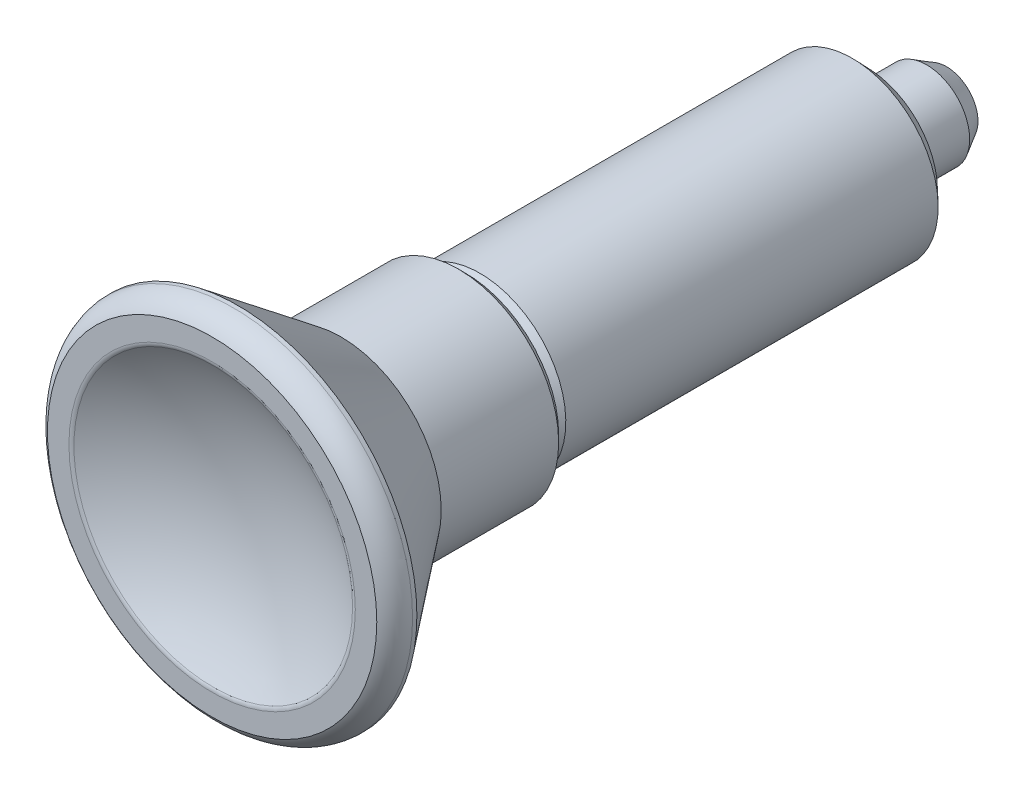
ISO-10303-21;
HEADER;
FILE_DESCRIPTION(('STEP AP214'),'2;1');
FILE_NAME('part.step','',(''),(''),'','','');
FILE_SCHEMA(('AUTOMOTIVE_DESIGN { 1 0 10303 214 1 1 1 1 }'));
ENDSEC;
DATA;
#1=APPLICATION_CONTEXT('core data for automotive mechanical design processes');
#2=APPLICATION_PROTOCOL_DEFINITION('international standard','automotive_design',2000,#1);
#3=PRODUCT_CONTEXT('',#1,'mechanical');
#4=PRODUCT('Part','Part','',(#3));
#5=PRODUCT_RELATED_PRODUCT_CATEGORY('part','',(#4));
#6=PRODUCT_DEFINITION_FORMATION('','',#4);
#7=PRODUCT_DEFINITION_CONTEXT('part definition',#1,'design');
#8=PRODUCT_DEFINITION('design','',#6,#7);
#9=PRODUCT_DEFINITION_SHAPE('','',#8);
#10=(LENGTH_UNIT() NAMED_UNIT(*) SI_UNIT(.MILLI.,.METRE.));
#11=(NAMED_UNIT(*) PLANE_ANGLE_UNIT() SI_UNIT($,.RADIAN.));
#12=(NAMED_UNIT(*) SI_UNIT($,.STERADIAN.) SOLID_ANGLE_UNIT());
#13=UNCERTAINTY_MEASURE_WITH_UNIT(LENGTH_MEASURE(1.E-05),#10,'distance_accuracy_value','');
#14=(GEOMETRIC_REPRESENTATION_CONTEXT(3) GLOBAL_UNCERTAINTY_ASSIGNED_CONTEXT((#13)) GLOBAL_UNIT_ASSIGNED_CONTEXT((#10,
#11,#12)) REPRESENTATION_CONTEXT('',''));
#15=CARTESIAN_POINT('',(0.,0.,0.));
#16=DIRECTION('',(0.,0.,1.));
#17=DIRECTION('',(1.,0.,0.));
#18=AXIS2_PLACEMENT_3D('',#15,#16,#17);
#19=CARTESIAN_POINT('',(0.,0.,2.4980018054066E-13));
#20=DIRECTION('',(0.,0.,1.));
#21=DIRECTION('',(-0.383049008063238,0.923728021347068,0.));
#22=AXIS2_PLACEMENT_3D('',#19,#20,#21);
#23=SPHERICAL_SURFACE('',#22,5.9999999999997);
#24=CARTESIAN_POINT('',(0.,0.,-5.58107460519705));
#25=DIRECTION('',(0.,0.,1.));
#26=DIRECTION('',(0.923728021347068,0.383049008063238,0.));
#27=AXIS2_PLACEMENT_3D('',#24,#25,#26);
#28=CIRCLE('',#27,2.20263620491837);
#29=CARTESIAN_POINT('',(2.03463678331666,0.843717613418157,-5.58107460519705));
#30=VERTEX_POINT('',#29);
#31=EDGE_CURVE('E38',#30,#30,#28,.T.);
#32=ORIENTED_EDGE('',*,*,#31,.F.);
#33=EDGE_LOOP('',(#32));
#34=FACE_BOUND('',#33,.T.);
#35=ADVANCED_FACE('F12',(#34),#23,.T.);
#36=CARTESIAN_POINT('',(0.,0.,-4.19999999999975));
#37=DIRECTION('',(0.,0.,1.));
#38=DIRECTION('',(0.923728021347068,0.383049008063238,0.));
#39=AXIS2_PLACEMENT_3D('',#36,#37,#38);
#40=CONICAL_SURFACE('',#39,3.,0.523598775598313);
#41=ORIENTED_EDGE('',*,*,#31,.T.);
#42=EDGE_LOOP('',(#41));
#43=FACE_BOUND('',#42,.T.);
#44=CARTESIAN_POINT('',(0.,0.,-4.19999999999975));
#45=DIRECTION('',(0.,0.,1.));
#46=DIRECTION('',(0.923728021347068,0.383049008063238,0.));
#47=AXIS2_PLACEMENT_3D('',#44,#45,#46);
#48=CIRCLE('',#47,3.);
#49=CARTESIAN_POINT('',(2.7711840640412,1.14914702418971,-4.19999999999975));
#50=VERTEX_POINT('',#49);
#51=EDGE_CURVE('E35',#50,#50,#48,.T.);
#52=ORIENTED_EDGE('',*,*,#51,.F.);
#53=EDGE_LOOP('',(#52));
#54=FACE_BOUND('',#53,.T.);
#55=ADVANCED_FACE('F114',(#43,#54),#40,.T.);
#56=CARTESIAN_POINT('',(0.,0.,36.0000000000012));
#57=DIRECTION('',(0.,0.,1.));
#58=DIRECTION('',(0.923728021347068,0.383049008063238,0.));
#59=AXIS2_PLACEMENT_3D('',#56,#57,#58);
#60=CYLINDRICAL_SURFACE('',#59,3.);
#61=ORIENTED_EDGE('',*,*,#51,.T.);
#62=EDGE_LOOP('',(#61));
#63=FACE_BOUND('',#62,.T.);
#64=CARTESIAN_POINT('',(0.,0.,0.));
#65=DIRECTION('',(0.,0.,1.));
#66=DIRECTION('',(0.923728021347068,0.383049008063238,0.));
#67=AXIS2_PLACEMENT_3D('',#64,#65,#66);
#68=CIRCLE('',#67,3.);
#69=CARTESIAN_POINT('',(2.7711840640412,1.14914702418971,0.));
#70=VERTEX_POINT('',#69);
#71=EDGE_CURVE('E32',#70,#70,#68,.T.);
#72=ORIENTED_EDGE('',*,*,#71,.F.);
#73=EDGE_LOOP('',(#72));
#74=FACE_BOUND('',#73,.T.);
#75=ADVANCED_FACE('F117',(#63,#74),#60,.T.);
#76=CARTESIAN_POINT('',(-1.89609258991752,4.57245370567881,0.));
#77=DIRECTION('',(0.,0.,-1.));
#78=DIRECTION('',(-0.923728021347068,-0.383049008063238,0.));
#79=AXIS2_PLACEMENT_3D('',#76,#77,#78);
#80=PLANE('',#79);
#81=ORIENTED_EDGE('',*,*,#71,.T.);
#82=EDGE_LOOP('',(#81));
#83=FACE_BOUND('',#82,.T.);
#84=CARTESIAN_POINT('',(0.,0.,0.));
#85=DIRECTION('',(0.,0.,1.));
#86=DIRECTION('',(0.923728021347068,0.383049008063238,0.));
#87=AXIS2_PLACEMENT_3D('',#84,#85,#86);
#88=CIRCLE('',#87,4.95000000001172);
#89=CARTESIAN_POINT('',(4.57245370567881,1.89609258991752,0.));
#90=VERTEX_POINT('',#89);
#91=EDGE_CURVE('E27',#90,#90,#88,.T.);
#92=ORIENTED_EDGE('',*,*,#91,.F.);
#93=EDGE_LOOP('',(#92));
#94=FACE_BOUND('',#93,.T.);
#95=ADVANCED_FACE('F121',(#83,#94),#80,.T.);
#96=CARTESIAN_POINT('',(0.,0.,0.999999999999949));
#97=DIRECTION('',(0.,0.,1.));
#98=DIRECTION('',(0.923728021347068,0.383049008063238,0.));
#99=AXIS2_PLACEMENT_3D('',#96,#97,#98);
#100=CONICAL_SURFACE('',#99,6.00000000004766,0.809783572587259);
#101=ORIENTED_EDGE('',*,*,#91,.T.);
#102=EDGE_LOOP('',(#101));
#103=FACE_BOUND('',#102,.T.);
#104=CARTESIAN_POINT('',(0.,0.,0.999999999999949));
#105=DIRECTION('',(0.,0.,1.));
#106=DIRECTION('',(0.923728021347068,0.383049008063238,0.));
#107=AXIS2_PLACEMENT_3D('',#104,#105,#106);
#108=CIRCLE('',#107,6.00000000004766);
#109=CARTESIAN_POINT('',(5.54236812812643,2.29829404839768,0.99999999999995));
#110=VERTEX_POINT('',#109);
#111=EDGE_CURVE('E23',#110,#110,#108,.T.);
#112=ORIENTED_EDGE('',*,*,#111,.F.);
#113=EDGE_LOOP('',(#112));
#114=FACE_BOUND('',#113,.T.);
#115=ADVANCED_FACE('F125',(#103,#114),#100,.T.);
#116=CARTESIAN_POINT('',(0.,0.,36.0000000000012));
#117=DIRECTION('',(0.,0.,1.));
#118=DIRECTION('',(0.923728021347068,0.383049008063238,0.));
#119=AXIS2_PLACEMENT_3D('',#116,#117,#118);
#120=CYLINDRICAL_SURFACE('',#119,6.00000000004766);
#121=ORIENTED_EDGE('',*,*,#111,.T.);
#122=EDGE_LOOP('',(#121));
#123=FACE_BOUND('',#122,.T.);
#124=CARTESIAN_POINT('',(0.,0.,27.));
#125=DIRECTION('',(0.,0.,1.));
#126=DIRECTION('',(0.923728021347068,0.383049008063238,0.));
#127=AXIS2_PLACEMENT_3D('',#124,#125,#126);
#128=CIRCLE('',#127,6.00000000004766);
#129=CARTESIAN_POINT('',(5.54236812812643,2.29829404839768,27.));
#130=VERTEX_POINT('',#129);
#131=EDGE_CURVE('E19',#130,#130,#128,.T.);
#132=ORIENTED_EDGE('',*,*,#131,.F.);
#133=EDGE_LOOP('',(#132));
#134=FACE_BOUND('',#133,.T.);
#135=ADVANCED_FACE('F129',(#123,#134),#120,.T.);
#136=CARTESIAN_POINT('',(0.,0.,28.000000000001));
#137=DIRECTION('',(0.,0.,-1.));
#138=DIRECTION('',(-0.923728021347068,-0.383049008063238,0.));
#139=AXIS2_PLACEMENT_3D('',#136,#137,#138);
#140=CONICAL_SURFACE('',#139,5.00000000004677,0.785398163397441);
#141=ORIENTED_EDGE('',*,*,#131,.T.);
#142=EDGE_LOOP('',(#141));
#143=FACE_BOUND('',#142,.T.);
#144=CARTESIAN_POINT('',(0.,0.,28.000000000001));
#145=DIRECTION('',(0.,0.,1.));
#146=DIRECTION('',(0.923728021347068,0.383049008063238,0.));
#147=AXIS2_PLACEMENT_3D('',#144,#145,#146);
#148=CIRCLE('',#147,5.00000000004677);
#149=CARTESIAN_POINT('',(4.61864010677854,1.91524504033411,28.000000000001));
#150=VERTEX_POINT('',#149);
#151=EDGE_CURVE('E8',#150,#150,#148,.T.);
#152=ORIENTED_EDGE('',*,*,#151,.F.);
#153=EDGE_LOOP('',(#152));
#154=FACE_BOUND('',#153,.T.);
#155=ADVANCED_FACE('F112',(#143,#154),#140,.T.);
#156=CARTESIAN_POINT('',(-4.22152478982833E-13,0.,60.7643824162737));
#157=DIRECTION('',(0.,0.,-1.));
#158=DIRECTION('',(1.,0.,0.));
#159=AXIS2_PLACEMENT_3D('',#156,#157,#158);
#160=SPHERICAL_SURFACE('',#159,17.9999999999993);
#161=CARTESIAN_POINT('',(0.,0.,45.6206589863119));
#162=DIRECTION('',(0.,0.,-1.));
#163=DIRECTION('',(1.,0.,0.));
#164=AXIS2_PLACEMENT_3D('',#161,#162,#163);
#165=CIRCLE('',#164,9.72972973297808);
#166=CARTESIAN_POINT('',(9.72972973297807,0.,45.6206589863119));
#167=VERTEX_POINT('',#166);
#168=EDGE_CURVE('E42',#167,#167,#165,.T.);
#169=ORIENTED_EDGE('',*,*,#168,.F.);
#170=EDGE_LOOP('',(#169));
#171=FACE_BOUND('',#170,.T.);
#172=ADVANCED_FACE('F109',(#171),#160,.F.);
#173=CARTESIAN_POINT('',(0.,0.,45.2000000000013));
#174=DIRECTION('',(0.,0.,-1.));
#175=DIRECTION('',(0.,1.,0.));
#176=AXIS2_PLACEMENT_3D('',#173,#174,#175);
#177=TOROIDAL_SURFACE('',#176,10.0000000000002,0.50000000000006);
#178=ORIENTED_EDGE('',*,*,#168,.T.);
#179=EDGE_LOOP('',(#178));
#180=FACE_BOUND('',#179,.T.);
#181=CARTESIAN_POINT('',(0.,0.,45.7000000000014));
#182=DIRECTION('',(0.,0.,-1.));
#183=DIRECTION('',(1.,0.,0.));
#184=AXIS2_PLACEMENT_3D('',#181,#182,#183);
#185=CIRCLE('',#184,10.);
#186=CARTESIAN_POINT('',(10.,0.,45.7000000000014));
#187=VERTEX_POINT('',#186);
#188=EDGE_CURVE('E46',#187,#187,#185,.T.);
#189=ORIENTED_EDGE('',*,*,#188,.F.);
#190=EDGE_LOOP('',(#189));
#191=FACE_BOUND('',#190,.T.);
#192=ADVANCED_FACE('F107',(#180,#191),#177,.T.);
#193=CARTESIAN_POINT('',(-12.65,-12.65,45.7000000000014));
#194=DIRECTION('',(0.,0.,1.));
#195=DIRECTION('',(1.,0.,0.));
#196=AXIS2_PLACEMENT_3D('',#193,#194,#195);
#197=PLANE('',#196);
#198=CARTESIAN_POINT('',(0.,0.,45.7000000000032));
#199=DIRECTION('',(0.,0.,-1.));
#200=DIRECTION('',(1.,0.,0.));
#201=AXIS2_PLACEMENT_3D('',#198,#199,#200);
#202=CIRCLE('',#201,11.4999999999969);
#203=CARTESIAN_POINT('',(11.4999999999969,0.,45.7000000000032));
#204=VERTEX_POINT('',#203);
#205=EDGE_CURVE('E50',#204,#204,#202,.T.);
#206=ORIENTED_EDGE('',*,*,#205,.F.);
#207=EDGE_LOOP('',(#206));
#208=FACE_BOUND('',#207,.T.);
#209=ORIENTED_EDGE('',*,*,#188,.T.);
#210=EDGE_LOOP('',(#209));
#211=FACE_BOUND('',#210,.T.);
#212=ADVANCED_FACE('F104',(#208,#211),#197,.T.);
#213=CARTESIAN_POINT('',(0.,0.,43.9596620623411));
#214=DIRECTION('',(0.,0.,-1.));
#215=DIRECTION('',(-1.,0.,0.));
#216=AXIS2_PLACEMENT_3D('',#213,#214,#215);
#217=TOROIDAL_SURFACE('',#216,10.5144930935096,2.00000000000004);
#218=ORIENTED_EDGE('',*,*,#205,.T.);
#219=EDGE_LOOP('',(#218));
#220=FACE_BOUND('',#219,.T.);
#221=CARTESIAN_POINT('',(0.,0.,44.200000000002));
#222=DIRECTION('',(0.,0.,-1.));
#223=DIRECTION('',(1.,0.,0.));
#224=AXIS2_PLACEMENT_3D('',#221,#222,#223);
#225=CIRCLE('',#224,12.5);
#226=CARTESIAN_POINT('',(12.5,0.,44.200000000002));
#227=VERTEX_POINT('',#226);
#228=EDGE_CURVE('E54',#227,#227,#225,.T.);
#229=ORIENTED_EDGE('',*,*,#228,.F.);
#230=EDGE_LOOP('',(#229));
#231=FACE_BOUND('',#230,.T.);
#232=ADVANCED_FACE('F14',(#220,#231),#217,.T.);
#233=CARTESIAN_POINT('',(0.,0.,44.200000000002));
#234=DIRECTION('',(0.,0.,-1.));
#235=DIRECTION('',(1.,0.,0.));
#236=AXIS2_PLACEMENT_3D('',#233,#234,#235);
#237=CYLINDRICAL_SURFACE('',#236,12.5);
#238=ORIENTED_EDGE('',*,*,#228,.T.);
#239=EDGE_LOOP('',(#238));
#240=FACE_BOUND('',#239,.T.);
#241=CARTESIAN_POINT('',(0.,0.,43.9000000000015));
#242=DIRECTION('',(0.,0.,-1.));
#243=DIRECTION('',(1.,0.,0.));
#244=AXIS2_PLACEMENT_3D('',#241,#242,#243);
#245=CIRCLE('',#244,12.5);
#246=CARTESIAN_POINT('',(12.5,0.,43.9000000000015));
#247=VERTEX_POINT('',#246);
#248=EDGE_CURVE('E58',#247,#247,#245,.T.);
#249=ORIENTED_EDGE('',*,*,#248,.F.);
#250=EDGE_LOOP('',(#249));
#251=FACE_BOUND('',#250,.T.);
#252=ADVANCED_FACE('F99',(#240,#251),#237,.T.);
#253=CARTESIAN_POINT('',(0.,0.,36.700000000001));
#254=DIRECTION('',(0.,0.,1.));
#255=DIRECTION('',(1.,0.,0.));
#256=AXIS2_PLACEMENT_3D('',#253,#254,#255);
#257=CONICAL_SURFACE('',#256,7.,0.652330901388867);
#258=ORIENTED_EDGE('',*,*,#248,.T.);
#259=EDGE_LOOP('',(#258));
#260=FACE_BOUND('',#259,.T.);
#261=CARTESIAN_POINT('',(0.,0.,36.700000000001));
#262=DIRECTION('',(0.,0.,-1.));
#263=DIRECTION('',(1.,0.,0.));
#264=AXIS2_PLACEMENT_3D('',#261,#262,#263);
#265=CIRCLE('',#264,7.);
#266=CARTESIAN_POINT('',(6.99999999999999,0.,36.700000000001));
#267=VERTEX_POINT('',#266);
#268=EDGE_CURVE('E62',#267,#267,#265,.T.);
#269=ORIENTED_EDGE('',*,*,#268,.F.);
#270=EDGE_LOOP('',(#269));
#271=FACE_BOUND('',#270,.T.);
#272=ADVANCED_FACE('F92',(#260,#271),#257,.T.);
#273=CARTESIAN_POINT('',(0.,0.,36.700000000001));
#274=DIRECTION('',(0.,0.,-1.));
#275=DIRECTION('',(1.,0.,0.));
#276=AXIS2_PLACEMENT_3D('',#273,#274,#275);
#277=CYLINDRICAL_SURFACE('',#276,7.);
#278=CARTESIAN_POINT('',(0.,0.,28.500000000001));
#279=DIRECTION('',(0.,0.,1.));
#280=DIRECTION('',(1.,0.,0.));
#281=AXIS2_PLACEMENT_3D('',#278,#279,#280);
#282=CIRCLE('',#281,7.);
#283=CARTESIAN_POINT('',(6.99999999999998,0.,28.500000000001));
#284=VERTEX_POINT('',#283);
#285=EDGE_CURVE('E66',#284,#284,#282,.T.);
#286=ORIENTED_EDGE('',*,*,#285,.T.);
#287=EDGE_LOOP('',(#286));
#288=FACE_BOUND('',#287,.T.);
#289=ORIENTED_EDGE('',*,*,#268,.T.);
#290=EDGE_LOOP('',(#289));
#291=FACE_BOUND('',#290,.T.);
#292=ADVANCED_FACE('F82',(#288,#291),#277,.T.);
#293=CARTESIAN_POINT('',(0.,0.,28.000000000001));
#294=DIRECTION('',(0.,0.,1.));
#295=DIRECTION('',(1.,0.,0.));
#296=AXIS2_PLACEMENT_3D('',#293,#294,#295);
#297=CONICAL_SURFACE('',#296,6.5,0.785398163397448);
#298=ORIENTED_EDGE('',*,*,#285,.F.);
#299=EDGE_LOOP('',(#298));
#300=FACE_BOUND('',#299,.T.);
#301=CARTESIAN_POINT('',(0.,0.,28.000000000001));
#302=DIRECTION('',(0.,0.,-1.));
#303=DIRECTION('',(1.,0.,0.));
#304=AXIS2_PLACEMENT_3D('',#301,#302,#303);
#305=CIRCLE('',#304,6.5);
#306=CARTESIAN_POINT('',(6.5,0.,28.000000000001));
#307=VERTEX_POINT('',#306);
#308=EDGE_CURVE('E41',#307,#307,#305,.T.);
#309=ORIENTED_EDGE('',*,*,#308,.F.);
#310=EDGE_LOOP('',(#309));
#311=FACE_BOUND('',#310,.T.);
#312=ADVANCED_FACE('F80',(#300,#311),#297,.T.);
#313=CARTESIAN_POINT('',(-7.7,7.7,28.000000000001));
#314=DIRECTION('',(0.,0.,-1.));
#315=DIRECTION('',(1.,0.,0.));
#316=AXIS2_PLACEMENT_3D('',#313,#314,#315);
#317=PLANE('',#316);
#318=ORIENTED_EDGE('',*,*,#151,.T.);
#319=EDGE_LOOP('',(#318));
#320=FACE_BOUND('',#319,.T.);
#321=ORIENTED_EDGE('',*,*,#308,.T.);
#322=EDGE_LOOP('',(#321));
#323=FACE_BOUND('',#322,.T.);
#324=ADVANCED_FACE('F78',(#320,#323),#317,.T.);
#325=CLOSED_SHELL('',(#35,#55,#75,#95,#115,#135,#155,#172,#192,#212,#232,#252,#272,#292,#312,#324));
#326=MANIFOLD_SOLID_BREP('B1',#325);
#327=ADVANCED_BREP_SHAPE_REPRESENTATION('',(#18,#326),#14);
#328=SHAPE_DEFINITION_REPRESENTATION(#9,#327);
ENDSEC;
END-ISO-10303-21;
